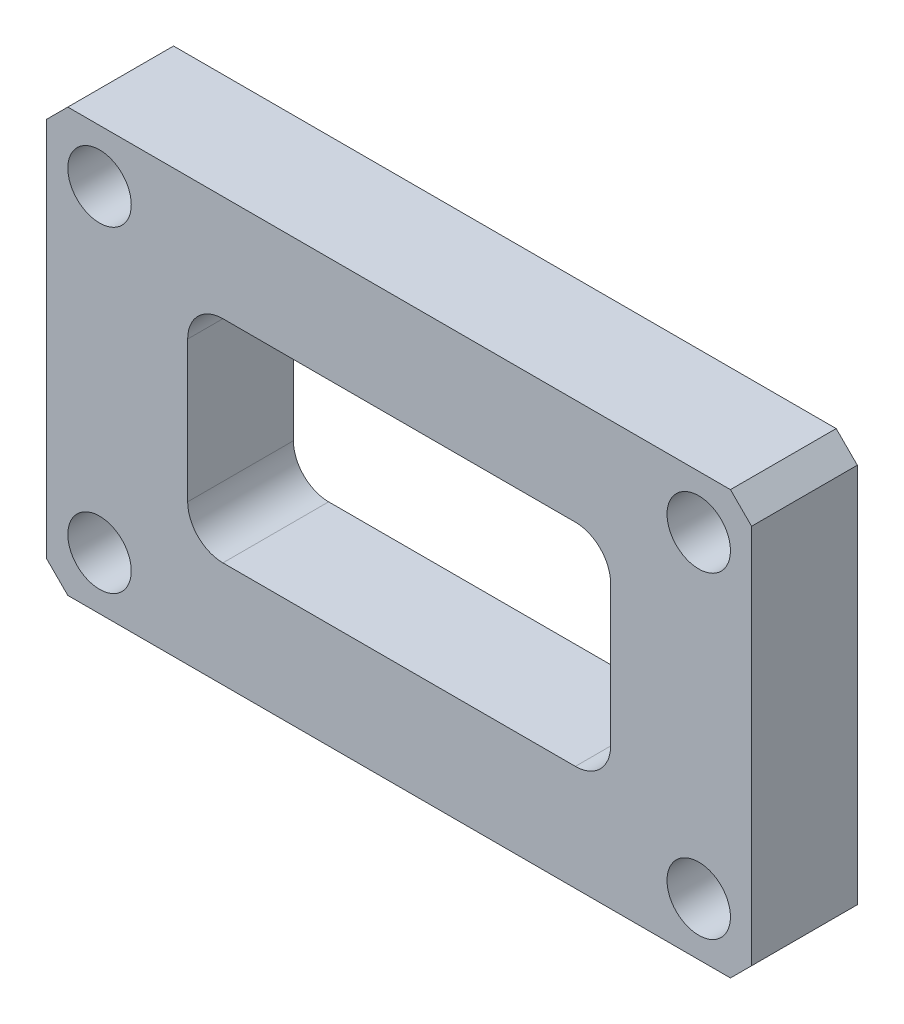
from build123d import *

# Parameters (mm, degrees)
SKETCH_1_W            = 100
SKETCH_1_H            = 60
EXTRUDE_1_DEPTH       = 15
CUT_EXTRUDE_1_REACH   = 62.208
SKETCH_2_W            = 60
SKETCH_2_H            = 30
FILLET_1_R            = 5
CHAMFER_1_SIZE        = 3
HOLE_WIZARD_9_0_9_1_D = 9


with BuildPart() as part:
    # Sketch 1 → Extrude 1 (new body)
    with BuildSketch(Plane.XY):
        Rectangle(SKETCH_1_W, SKETCH_1_H)
    extrude(amount=EXTRUDE_1_DEPTH)

    # Sketch 2 → Cut-Extrude 1 (cut, up to next)
    with BuildSketch(Plane.XY.offset(15), mode=Mode.PRIVATE) as cut_extrude_1_sk1:
        Rectangle(SKETCH_2_W, SKETCH_2_H)
    cut_extrude_1_tool1 = extrude(cut_extrude_1_sk1.sketch, amount=-CUT_EXTRUDE_1_REACH, mode=Mode.PRIVATE) & part.part
    add(cut_extrude_1_tool1.solids().sort_by_distance((0, 0, 15))[0], mode=Mode.SUBTRACT)

    # Fillet 1
    fillet_1_edges = [part.edges().sort_by_distance(p)[0] for p in [
        (30, 15, 7.5),
        (30, -15, 7.5),
        (-30, -15, 7.5),
        (-30, 15, 7.5),
    ]]
    fillet(fillet_1_edges, radius=FILLET_1_R)

    # Chamfer 1
    chamfer_1_edges = [part.edges().sort_by_distance(p)[0] for p in [
        (50, -30, 7.5),
        (-50, -30, 7.5),
        (-50, 30, 7.5),
        (50, 30, 7.5),
    ]]
    chamfer(chamfer_1_edges, length=CHAMFER_1_SIZE)

    # Hole Wizard 9.0 _9_ _1 (through all)
    with Locations(Plane.XY.offset(15)):
        with Locations((-42.5, -22.5), (42.5, 22.5), (-42.5, 22.5), (42.5, -22.5)):
            Hole(HOLE_WIZARD_9_0_9_1_D / 2)


solid = part.part
